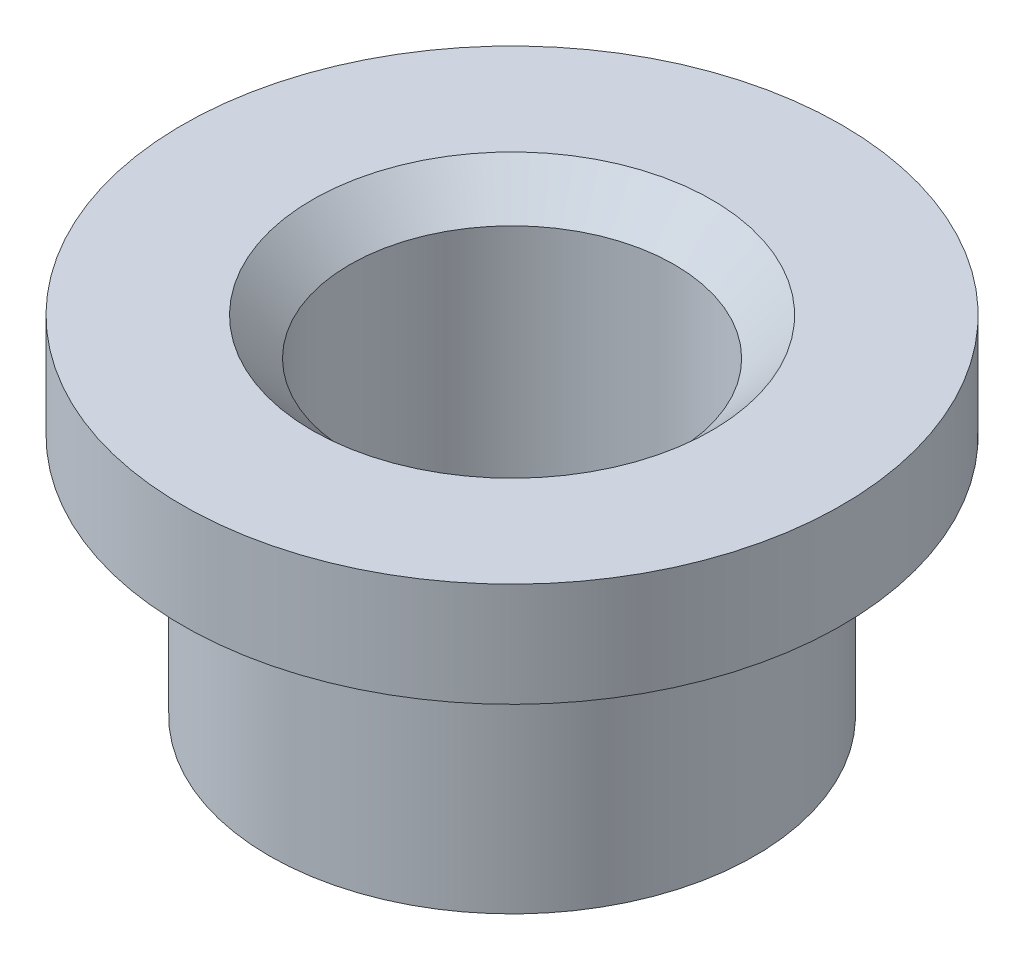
ISO-10303-21;
HEADER;
FILE_DESCRIPTION(('STEP AP214'),'2;1');
FILE_NAME('part.step','',(''),(''),'','','');
FILE_SCHEMA(('AUTOMOTIVE_DESIGN { 1 0 10303 214 1 1 1 1 }'));
ENDSEC;
DATA;
#1=APPLICATION_CONTEXT('core data for automotive mechanical design processes');
#2=APPLICATION_PROTOCOL_DEFINITION('international standard','automotive_design',2000,#1);
#3=PRODUCT_CONTEXT('',#1,'mechanical');
#4=PRODUCT('Part','Part','',(#3));
#5=PRODUCT_RELATED_PRODUCT_CATEGORY('part','',(#4));
#6=PRODUCT_DEFINITION_FORMATION('','',#4);
#7=PRODUCT_DEFINITION_CONTEXT('part definition',#1,'design');
#8=PRODUCT_DEFINITION('design','',#6,#7);
#9=PRODUCT_DEFINITION_SHAPE('','',#8);
#10=(LENGTH_UNIT() NAMED_UNIT(*) SI_UNIT(.MILLI.,.METRE.));
#11=(NAMED_UNIT(*) PLANE_ANGLE_UNIT() SI_UNIT($,.RADIAN.));
#12=(NAMED_UNIT(*) SI_UNIT($,.STERADIAN.) SOLID_ANGLE_UNIT());
#13=UNCERTAINTY_MEASURE_WITH_UNIT(LENGTH_MEASURE(1.E-05),#10,'distance_accuracy_value','');
#14=(GEOMETRIC_REPRESENTATION_CONTEXT(3) GLOBAL_UNCERTAINTY_ASSIGNED_CONTEXT((#13)) GLOBAL_UNIT_ASSIGNED_CONTEXT((#10,
#11,#12)) REPRESENTATION_CONTEXT('',''));
#15=CARTESIAN_POINT('',(0.,0.,0.));
#16=DIRECTION('',(0.,0.,1.));
#17=DIRECTION('',(1.,0.,0.));
#18=AXIS2_PLACEMENT_3D('',#15,#16,#17);
#19=CARTESIAN_POINT('',(0.,3.81,0.));
#20=DIRECTION('',(0.,-1.,0.));
#21=DIRECTION('',(0.,0.,-1.));
#22=AXIS2_PLACEMENT_3D('',#19,#20,#21);
#23=CYLINDRICAL_SURFACE('',#22,12.065);
#24=CARTESIAN_POINT('',(0.,3.81,0.));
#25=DIRECTION('',(0.,1.,0.));
#26=DIRECTION('',(0.,0.,1.));
#27=AXIS2_PLACEMENT_3D('',#24,#25,#26);
#28=CIRCLE('',#27,12.065);
#29=CARTESIAN_POINT('',(0.,3.81,-12.065));
#30=VERTEX_POINT('',#29);
#31=EDGE_CURVE('E42',#30,#30,#28,.T.);
#32=CARTESIAN_POINT('',(0.,0.,0.));
#33=DIRECTION('',(0.,1.,0.));
#34=DIRECTION('',(0.,0.,1.));
#35=AXIS2_PLACEMENT_3D('',#32,#33,#34);
#36=CIRCLE('',#35,12.065);
#37=CARTESIAN_POINT('',(0.,0.,-12.065));
#38=VERTEX_POINT('',#37);
#39=EDGE_CURVE('E38',#38,#38,#36,.T.);
#40=CARTESIAN_POINT('',(0.,3.81,-12.065));
#41=CARTESIAN_POINT('',(0.,3.7703125,-12.065));
#42=CARTESIAN_POINT('',(0.,3.730625,-12.065));
#43=CARTESIAN_POINT('',(0.,3.65125,-12.065));
#44=CARTESIAN_POINT('',(0.,3.6115625,-12.065));
#45=CARTESIAN_POINT('',(0.,3.5321875,-12.065));
#46=CARTESIAN_POINT('',(0.,3.4925,-12.065));
#47=CARTESIAN_POINT('',(0.,3.413125,-12.065));
#48=CARTESIAN_POINT('',(0.,3.3734375,-12.065));
#49=CARTESIAN_POINT('',(0.,3.2940625,-12.065));
#50=CARTESIAN_POINT('',(0.,3.254375,-12.065));
#51=CARTESIAN_POINT('',(0.,3.175,-12.065));
#52=CARTESIAN_POINT('',(0.,3.1353125,-12.065));
#53=CARTESIAN_POINT('',(0.,3.0559375,-12.065));
#54=CARTESIAN_POINT('',(0.,3.01625,-12.065));
#55=CARTESIAN_POINT('',(0.,2.936875,-12.065));
#56=CARTESIAN_POINT('',(0.,2.8971875,-12.065));
#57=CARTESIAN_POINT('',(0.,2.8178125,-12.065));
#58=CARTESIAN_POINT('',(0.,2.778125,-12.065));
#59=CARTESIAN_POINT('',(0.,2.69875,-12.065));
#60=CARTESIAN_POINT('',(0.,2.6590625,-12.065));
#61=CARTESIAN_POINT('',(0.,2.5796875,-12.065));
#62=CARTESIAN_POINT('',(0.,2.54,-12.065));
#63=CARTESIAN_POINT('',(0.,2.460625,-12.065));
#64=CARTESIAN_POINT('',(0.,2.4209375,-12.065));
#65=CARTESIAN_POINT('',(0.,2.3415625,-12.065));
#66=CARTESIAN_POINT('',(0.,2.301875,-12.065));
#67=CARTESIAN_POINT('',(0.,2.2225,-12.065));
#68=CARTESIAN_POINT('',(0.,2.1828125,-12.065));
#69=CARTESIAN_POINT('',(0.,2.1034375,-12.065));
#70=CARTESIAN_POINT('',(0.,2.06375,-12.065));
#71=CARTESIAN_POINT('',(0.,1.984375,-12.065));
#72=CARTESIAN_POINT('',(0.,1.9446875,-12.065));
#73=CARTESIAN_POINT('',(0.,1.8653125,-12.065));
#74=CARTESIAN_POINT('',(0.,1.825625,-12.065));
#75=CARTESIAN_POINT('',(0.,1.74625,-12.065));
#76=CARTESIAN_POINT('',(0.,1.7065625,-12.065));
#77=CARTESIAN_POINT('',(0.,1.6271875,-12.065));
#78=CARTESIAN_POINT('',(0.,1.5875,-12.065));
#79=CARTESIAN_POINT('',(0.,1.508125,-12.065));
#80=CARTESIAN_POINT('',(0.,1.4684375,-12.065));
#81=CARTESIAN_POINT('',(0.,1.3890625,-12.065));
#82=CARTESIAN_POINT('',(0.,1.349375,-12.065));
#83=CARTESIAN_POINT('',(0.,1.27,-12.065));
#84=CARTESIAN_POINT('',(0.,1.2303125,-12.065));
#85=CARTESIAN_POINT('',(0.,1.1509375,-12.065));
#86=CARTESIAN_POINT('',(0.,1.11125,-12.065));
#87=CARTESIAN_POINT('',(0.,1.031875,-12.065));
#88=CARTESIAN_POINT('',(0.,0.9921875,-12.065));
#89=CARTESIAN_POINT('',(0.,0.9128125,-12.065));
#90=CARTESIAN_POINT('',(0.,0.873125,-12.065));
#91=CARTESIAN_POINT('',(0.,0.79375,-12.065));
#92=CARTESIAN_POINT('',(0.,0.7540625,-12.065));
#93=CARTESIAN_POINT('',(0.,0.6746875,-12.065));
#94=CARTESIAN_POINT('',(0.,0.635,-12.065));
#95=CARTESIAN_POINT('',(0.,0.555625,-12.065));
#96=CARTESIAN_POINT('',(0.,0.5159375,-12.065));
#97=CARTESIAN_POINT('',(0.,0.4365625,-12.065));
#98=CARTESIAN_POINT('',(0.,0.396875,-12.065));
#99=CARTESIAN_POINT('',(0.,0.3175,-12.065));
#100=CARTESIAN_POINT('',(0.,0.2778125,-12.065));
#101=CARTESIAN_POINT('',(0.,0.1984375,-12.065));
#102=CARTESIAN_POINT('',(0.,0.15875,-12.065));
#103=CARTESIAN_POINT('',(0.,0.0793749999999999,-12.065));
#104=CARTESIAN_POINT('',(0.,0.0396874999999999,-12.065));
#105=CARTESIAN_POINT('',(0.,0.,-12.065));
#106=B_SPLINE_CURVE_WITH_KNOTS('',3,(#40,#41,#42,#43,#44,#45,#46,#47,#48,#49,#50,#51,#52,#53,
#54,#55,#56,#57,#58,#59,#60,#61,#62,#63,#64,#65,#66,#67,#68,#69,#70,#71,#72,#73,#74,#75,#76,#77,
#78,#79,#80,#81,#82,#83,#84,#85,#86,#87,#88,#89,#90,#91,#92,#93,#94,#95,#96,#97,#98,#99,#100,
#101,#102,#103,#104,#105),.UNSPECIFIED.,.F.,.F.,(4,2,2,2,2,2,2,2,2,2,2,2,2,2,2,2,2,2,2,2,2,2,2,
2,2,2,2,2,2,2,2,2,4),(0.,0.1190625,0.238125,0.3571875,0.47625,0.595312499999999,0.714375,
0.833437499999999,0.952499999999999,1.0715625,1.190625,1.3096875,1.42875,1.5478125,1.666875,
1.7859375,1.905,2.0240625,2.143125,2.2621875,2.38125,2.5003125,2.619375,2.7384375,2.8575,
2.9765625,3.095625,3.2146875,3.33375,3.4528125,3.571875,3.6909375,3.81),.UNSPECIFIED.);
#107=EDGE_CURVE('BSEAM35',#30,#38,#106,.T.);
#108=ORIENTED_EDGE('',*,*,#31,.F.);
#109=ORIENTED_EDGE('',*,*,#39,.T.);
#110=ORIENTED_EDGE('',*,*,#107,.T.);
#111=ORIENTED_EDGE('',*,*,#107,.F.);
#112=EDGE_LOOP('',(#108,#110,#109,#111));
#113=FACE_BOUND('',#112,.T.);
#114=ADVANCED_FACE('F35',(#113),#23,.T.);
#115=CARTESIAN_POINT('',(0.,3.81,0.));
#116=DIRECTION('',(0.,1.,0.));
#117=DIRECTION('',(0.,0.,1.));
#118=AXIS2_PLACEMENT_3D('',#115,#116,#117);
#119=PLANE('',#118);
#120=CARTESIAN_POINT('',(0.,3.81,0.));
#121=DIRECTION('',(0.,1.,0.));
#122=DIRECTION('',(0.,0.,1.));
#123=AXIS2_PLACEMENT_3D('',#120,#121,#122);
#124=CIRCLE('',#123,7.3152);
#125=CARTESIAN_POINT('',(0.,3.81,7.3152));
#126=VERTEX_POINT('',#125);
#127=EDGE_CURVE('E57',#126,#126,#124,.T.);
#128=ORIENTED_EDGE('',*,*,#127,.F.);
#129=EDGE_LOOP('',(#128));
#130=FACE_BOUND('',#129,.T.);
#131=ORIENTED_EDGE('',*,*,#31,.T.);
#132=EDGE_LOOP('',(#131));
#133=FACE_BOUND('',#132,.T.);
#134=ADVANCED_FACE('F63',(#130,#133),#119,.T.);
#135=CARTESIAN_POINT('',(0.,0.,0.));
#136=DIRECTION('',(0.,1.,0.));
#137=DIRECTION('',(0.,0.,1.));
#138=AXIS2_PLACEMENT_3D('',#135,#136,#137);
#139=PLANE('',#138);
#140=CARTESIAN_POINT('',(0.,0.,0.));
#141=DIRECTION('',(0.,-1.,0.));
#142=DIRECTION('',(0.,0.,-1.));
#143=AXIS2_PLACEMENT_3D('',#140,#141,#142);
#144=CIRCLE('',#143,8.89);
#145=CARTESIAN_POINT('',(0.,0.,-8.89));
#146=VERTEX_POINT('',#145);
#147=EDGE_CURVE('E10',#146,#146,#144,.T.);
#148=ORIENTED_EDGE('',*,*,#147,.F.);
#149=EDGE_LOOP('',(#148));
#150=FACE_BOUND('',#149,.T.);
#151=ORIENTED_EDGE('',*,*,#39,.F.);
#152=EDGE_LOOP('',(#151));
#153=FACE_BOUND('',#152,.T.);
#154=ADVANCED_FACE('F66',(#150,#153),#139,.F.);
#155=CARTESIAN_POINT('',(0.,-8.89,0.));
#156=DIRECTION('',(0.,1.,0.));
#157=DIRECTION('',(0.,0.,1.));
#158=AXIS2_PLACEMENT_3D('',#155,#156,#157);
#159=CYLINDRICAL_SURFACE('',#158,8.89);
#160=CARTESIAN_POINT('',(0.,-8.89,0.));
#161=DIRECTION('',(0.,-1.,0.));
#162=DIRECTION('',(0.,0.,-1.));
#163=AXIS2_PLACEMENT_3D('',#160,#161,#162);
#164=CIRCLE('',#163,8.89);
#165=CARTESIAN_POINT('',(0.,-8.89,-8.89));
#166=VERTEX_POINT('',#165);
#167=EDGE_CURVE('E48',#166,#166,#164,.T.);
#168=ORIENTED_EDGE('',*,*,#167,.F.);
#169=EDGE_LOOP('',(#168));
#170=FACE_BOUND('',#169,.T.);
#171=ORIENTED_EDGE('',*,*,#147,.T.);
#172=EDGE_LOOP('',(#171));
#173=FACE_BOUND('',#172,.T.);
#174=ADVANCED_FACE('F76',(#170,#173),#159,.T.);
#175=CARTESIAN_POINT('',(0.,-8.89,0.));
#176=DIRECTION('',(0.,-1.,0.));
#177=DIRECTION('',(0.,0.,-1.));
#178=AXIS2_PLACEMENT_3D('',#175,#176,#177);
#179=PLANE('',#178);
#180=CARTESIAN_POINT('',(0.,-8.89,0.));
#181=DIRECTION('',(0.,1.,0.));
#182=DIRECTION('',(0.,0.,1.));
#183=AXIS2_PLACEMENT_3D('',#180,#181,#182);
#184=CIRCLE('',#183,5.9436);
#185=CARTESIAN_POINT('',(0.,-8.89,5.9436));
#186=VERTEX_POINT('',#185);
#187=EDGE_CURVE('E51',#186,#186,#184,.T.);
#188=ORIENTED_EDGE('',*,*,#187,.T.);
#189=EDGE_LOOP('',(#188));
#190=FACE_BOUND('',#189,.T.);
#191=ORIENTED_EDGE('',*,*,#167,.T.);
#192=EDGE_LOOP('',(#191));
#193=FACE_BOUND('',#192,.T.);
#194=ADVANCED_FACE('F81',(#190,#193),#179,.T.);
#195=CARTESIAN_POINT('',(0.,3.81,0.));
#196=DIRECTION('',(0.,1.,0.));
#197=DIRECTION('',(0.,0.,1.));
#198=AXIS2_PLACEMENT_3D('',#195,#196,#197);
#199=CYLINDRICAL_SURFACE('',#198,5.9436);
#200=ORIENTED_EDGE('',*,*,#187,.F.);
#201=EDGE_LOOP('',(#200));
#202=FACE_BOUND('',#201,.T.);
#203=CARTESIAN_POINT('',(0.,2.4384,0.));
#204=DIRECTION('',(0.,1.,0.));
#205=DIRECTION('',(0.,0.,1.));
#206=AXIS2_PLACEMENT_3D('',#203,#204,#205);
#207=CIRCLE('',#206,5.9436);
#208=CARTESIAN_POINT('',(0.,2.4384,5.9436));
#209=VERTEX_POINT('',#208);
#210=EDGE_CURVE('E54',#209,#209,#207,.T.);
#211=ORIENTED_EDGE('',*,*,#210,.T.);
#212=EDGE_LOOP('',(#211));
#213=FACE_BOUND('',#212,.T.);
#214=ADVANCED_FACE('F87',(#202,#213),#199,.F.);
#215=CARTESIAN_POINT('',(0.,3.81,0.));
#216=DIRECTION('',(0.,1.,0.));
#217=DIRECTION('',(0.,0.,1.));
#218=AXIS2_PLACEMENT_3D('',#215,#216,#217);
#219=CONICAL_SURFACE('',#218,7.3152,0.78539816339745);
#220=ORIENTED_EDGE('',*,*,#210,.F.);
#221=EDGE_LOOP('',(#220));
#222=FACE_BOUND('',#221,.T.);
#223=ORIENTED_EDGE('',*,*,#127,.T.);
#224=EDGE_LOOP('',(#223));
#225=FACE_BOUND('',#224,.T.);
#226=ADVANCED_FACE('F61',(#222,#225),#219,.F.);
#227=CLOSED_SHELL('',(#114,#134,#154,#174,#194,#214,#226));
#228=MANIFOLD_SOLID_BREP('B2',#227);
#229=ADVANCED_BREP_SHAPE_REPRESENTATION('',(#18,#228),#14);
#230=SHAPE_DEFINITION_REPRESENTATION(#9,#229);
ENDSEC;
END-ISO-10303-21;
